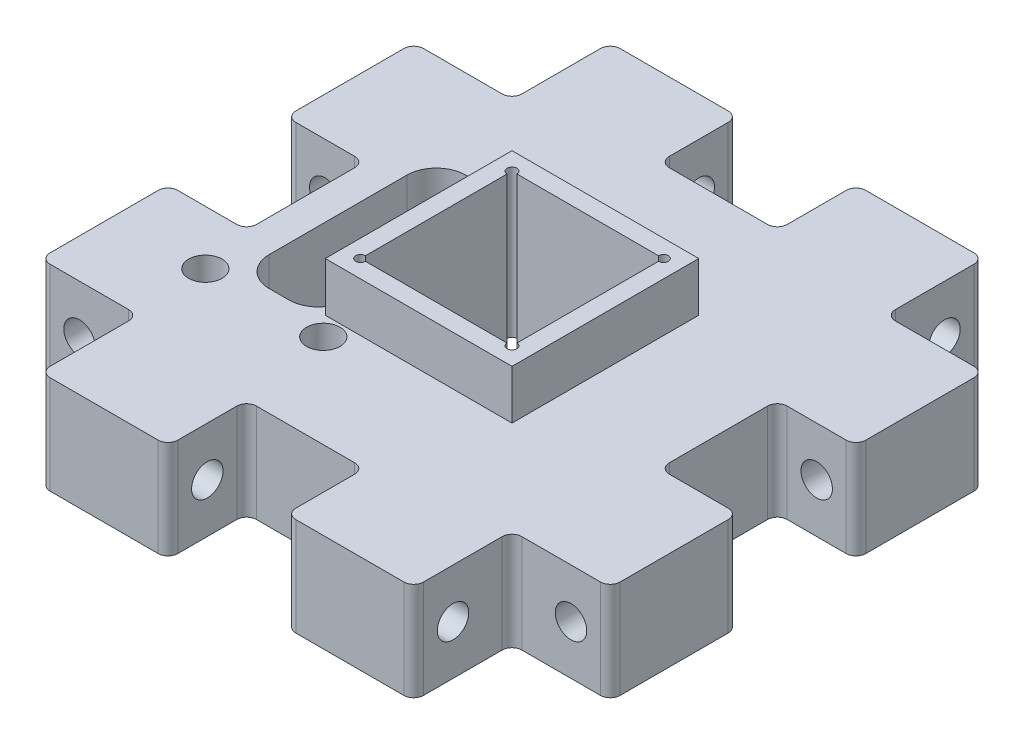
from build123d import *
from build123d.topology import SkipClean

# Parameters (mm, degrees)
SKETCH_1_W              = 58
SKETCH_1_H              = 58
SKETCH_1_W_2            = 15.4
SKETCH_1_H_2            = 15.4
EXTRUDE_1_DEPTH         = 10
CUT_EXTRUDE_1_REACH     = 44.214
SKETCH_2_W              = 12
SKETCH_2_H              = 8
SKETCH_2_W_2            = 8
SKETCH_2_H_2            = 12
CUT_EXTRUDE_2_REACH     = 67.612
SKETCH_4_R              = 1.6
CUT_EXTRUDE_3_REACH     = 67.612
SKETCH_5_R              = 1.6
CUT_EXTRUDE_4_REACH     = 67.612
SKETCH_6_R              = 1.6
CUT_EXTRUDE_5_REACH     = 67.612
SKETCH_7_R              = 1.6
CUT_EXTRUDE_6_REACH     = 44.214
SKETCH_8_W              = 8
SKETCH_8_H              = 20
CUT_EXTRUDE_7_REACH     = 44.214
SKETCH_9_R              = 0.5
SKETCH_10_W             = 19
SKETCH_10_H             = 19
EXTRUDE_2_DEPTH         = 5
CUT_EXTRUDE_8_REACH     = 45.669
SKETCH_12_W             = 10
SKETCH_12_H             = 10
FILLET_2_R              = 1
HOLE_WIZARD_3_4_3_4_1_D = 3.4
FILLET_3_R              = 3
FILLET_4_R              = 1
CUT_EXTRUDE_9_DEPTH     = 2.4


with BuildPart() as part:
    # Sketch 1 → Extrude 1 (new body)
    with BuildSketch(Plane(origin=(0, 0, 0), x_dir=(1, 0, 0), z_dir=(0, 1, 0))):
        Rectangle(SKETCH_1_W, SKETCH_1_H)
        Rectangle(SKETCH_1_W_2, SKETCH_1_H_2, mode=Mode.SUBTRACT)
    extrude(amount=EXTRUDE_1_DEPTH)

    # Sketch 2 → Cut-Extrude 1 (cut, up to next)
    with BuildSketch(Plane(origin=(0, 10, 0), x_dir=(1, 0, 0), z_dir=(0, 1, 0)), mode=Mode.PRIVATE) as cut_extrude_1_sk1:
        with Locations((0, 25)):
            Rectangle(SKETCH_2_W, SKETCH_2_H)
    cut_extrude_1_tool1 = extrude(cut_extrude_1_sk1.sketch, amount=-CUT_EXTRUDE_1_REACH, mode=Mode.PRIVATE) & part.part
    # Sketch 2 → Cut-Extrude 1 (cut, up to next)
    with BuildSketch(Plane(origin=(0, 10, 0), x_dir=(1, 0, 0), z_dir=(0, 1, 0)), mode=Mode.PRIVATE) as cut_extrude_1_sk2:
        with Locations((25, 0)):
            Rectangle(SKETCH_2_W_2, SKETCH_2_H_2)
    cut_extrude_1_tool2 = extrude(cut_extrude_1_sk2.sketch, amount=-CUT_EXTRUDE_1_REACH, mode=Mode.PRIVATE) & part.part
    # Sketch 2 → Cut-Extrude 1 (cut, up to next)
    with BuildSketch(Plane(origin=(0, 10, 0), x_dir=(1, 0, 0), z_dir=(0, 1, 0)), mode=Mode.PRIVATE) as cut_extrude_1_sk3:
        with Locations((0, -25)):
            Rectangle(SKETCH_2_W, SKETCH_2_H)
    cut_extrude_1_tool3 = extrude(cut_extrude_1_sk3.sketch, amount=-CUT_EXTRUDE_1_REACH, mode=Mode.PRIVATE) & part.part
    # Sketch 2 → Cut-Extrude 1 (cut, up to next)
    with BuildSketch(Plane(origin=(0, 10, 0), x_dir=(1, 0, 0), z_dir=(0, 1, 0)), mode=Mode.PRIVATE) as cut_extrude_1_sk4:
        with Locations((-25, 0)):
            Rectangle(SKETCH_2_W_2, SKETCH_2_H_2)
    cut_extrude_1_tool4 = extrude(cut_extrude_1_sk4.sketch, amount=-CUT_EXTRUDE_1_REACH, mode=Mode.PRIVATE) & part.part
    add(cut_extrude_1_tool1.solids().sort_by_distance((0, 10, -25))[0], mode=Mode.SUBTRACT)
    add(cut_extrude_1_tool2.solids().sort_by_distance((25, 10, 0))[0], mode=Mode.SUBTRACT)
    add(cut_extrude_1_tool3.solids().sort_by_distance((0, 10, 25))[0], mode=Mode.SUBTRACT)
    add(cut_extrude_1_tool4.solids().sort_by_distance((-25, 10, 0))[0], mode=Mode.SUBTRACT)

    # Cut-Extrude 2: up to this face of the body (flat: up to its plane)
    cut_extrude_2_end = Plane(part.part.faces().sort_by_distance((29, 5, -17.5))[0])
    # Sketch 4 → Cut-Extrude 2 (cut, up to the picked face)
    with BuildSketch(Plane.ZY.offset(29), mode=Mode.PRIVATE) as cut_extrude_2_sk1:
        with Locations((-25, 5)):
            Circle(SKETCH_4_R)
    cut_extrude_2_tool1 = split(extrude(cut_extrude_2_sk1.sketch, amount=-CUT_EXTRUDE_2_REACH, mode=Mode.PRIVATE), bisect_by=cut_extrude_2_end, keep=Keep.BOTH, mode=Mode.PRIVATE)
    add(cut_extrude_2_tool1.solids().sort_by(Axis((-29, 5, -25), (1, 0, 0)))[0], mode=Mode.SUBTRACT)

    # Cut-Extrude 3: up to this face of the body (flat: up to its plane)
    cut_extrude_3_end = Plane(part.part.faces().sort_by_distance((-17.5, 5, 29))[0])
    # Sketch 5 → Cut-Extrude 3 (cut, up to the picked face)
    with BuildSketch(Plane(origin=(0, 0, -29), x_dir=(-1, 0, 0), z_dir=(0, 0, -1)), mode=Mode.PRIVATE) as cut_extrude_3_sk1:
        with Locations((25, 5)):
            Circle(SKETCH_5_R)
    cut_extrude_3_tool1 = split(extrude(cut_extrude_3_sk1.sketch, amount=-CUT_EXTRUDE_3_REACH, mode=Mode.PRIVATE), bisect_by=cut_extrude_3_end, keep=Keep.BOTH, mode=Mode.PRIVATE)
    add(cut_extrude_3_tool1.solids().sort_by(Axis((-25, 5, -29), (0, 0, 1)))[0], mode=Mode.SUBTRACT)

    # Cut-Extrude 4: up to this face of the body (flat: up to its plane)
    cut_extrude_4_end = Plane(part.part.faces().sort_by_distance((29, 5, 17.5))[0])
    # Sketch 6 → Cut-Extrude 4 (cut, up to the picked face)
    with BuildSketch(Plane.ZY.offset(29), mode=Mode.PRIVATE) as cut_extrude_4_sk1:
        with Locations((25, 5)):
            Circle(SKETCH_6_R)
    cut_extrude_4_tool1 = split(extrude(cut_extrude_4_sk1.sketch, amount=-CUT_EXTRUDE_4_REACH, mode=Mode.PRIVATE), bisect_by=cut_extrude_4_end, keep=Keep.BOTH, mode=Mode.PRIVATE)
    add(cut_extrude_4_tool1.solids().sort_by(Axis((-29, 5, 25), (1, 0, 0)))[0], mode=Mode.SUBTRACT)

    # Cut-Extrude 5: up to this face of the body (flat: up to its plane)
    cut_extrude_5_end = Plane(part.part.faces().sort_by_distance((17.5, 5, -29))[0])
    # Sketch 7 → Cut-Extrude 5 (cut, up to the picked face)
    with BuildSketch(Plane.XY.offset(29), mode=Mode.PRIVATE) as cut_extrude_5_sk1:
        with Locations((25, 5)):
            Circle(SKETCH_7_R)
    cut_extrude_5_tool1 = split(extrude(cut_extrude_5_sk1.sketch, amount=-CUT_EXTRUDE_5_REACH, mode=Mode.PRIVATE), bisect_by=cut_extrude_5_end, keep=Keep.BOTH, mode=Mode.PRIVATE)
    add(cut_extrude_5_tool1.solids().sort_by(Axis((25, 5, 29), (0, 0, -1)))[0], mode=Mode.SUBTRACT)

    # Sketch 8 → Cut-Extrude 6 (cut, up to next)
    with BuildSketch(Plane.XZ, mode=Mode.PRIVATE) as cut_extrude_6_sk1:
        with Locations((-13.7, 0)):
            Rectangle(SKETCH_8_W, SKETCH_8_H)
    cut_extrude_6_tool1 = extrude(cut_extrude_6_sk1.sketch, amount=-CUT_EXTRUDE_6_REACH, mode=Mode.PRIVATE) & part.part
    add(cut_extrude_6_tool1.solids().sort_by_distance((-13.7, 0, 0))[0], mode=Mode.SUBTRACT)

    # Sketch 9 → Cut-Extrude 7 (cut, up to next)
    with BuildSketch(Plane(origin=(0, 0, 0), x_dir=(-1, 0, 0), z_dir=(0, -1, 0)), mode=Mode.PRIVATE) as cut_extrude_7_sk1:
        with Locations((-7.7, -7.7)):
            Circle(SKETCH_9_R)
    cut_extrude_7_tool1 = extrude(cut_extrude_7_sk1.sketch, amount=-CUT_EXTRUDE_7_REACH, mode=Mode.PRIVATE) & part.part
    # Sketch 9 → Cut-Extrude 7 (cut, up to next)
    with BuildSketch(Plane(origin=(0, 0, 0), x_dir=(-1, 0, 0), z_dir=(0, -1, 0)), mode=Mode.PRIVATE) as cut_extrude_7_sk2:
        with Locations((-7.7, 7.7)):
            Circle(SKETCH_9_R)
    cut_extrude_7_tool2 = extrude(cut_extrude_7_sk2.sketch, amount=-CUT_EXTRUDE_7_REACH, mode=Mode.PRIVATE) & part.part
    # Sketch 9 → Cut-Extrude 7 (cut, up to next)
    with BuildSketch(Plane(origin=(0, 0, 0), x_dir=(-1, 0, 0), z_dir=(0, -1, 0)), mode=Mode.PRIVATE) as cut_extrude_7_sk3:
        with Locations((7.7, 7.7)):
            Circle(SKETCH_9_R)
    cut_extrude_7_tool3 = extrude(cut_extrude_7_sk3.sketch, amount=-CUT_EXTRUDE_7_REACH, mode=Mode.PRIVATE) & part.part
    # Sketch 9 → Cut-Extrude 7 (cut, up to next)
    with BuildSketch(Plane(origin=(0, 0, 0), x_dir=(-1, 0, 0), z_dir=(0, -1, 0)), mode=Mode.PRIVATE) as cut_extrude_7_sk4:
        with Locations((7.7, -7.7)):
            Circle(SKETCH_9_R)
    cut_extrude_7_tool4 = extrude(cut_extrude_7_sk4.sketch, amount=-CUT_EXTRUDE_7_REACH, mode=Mode.PRIVATE) & part.part
    add(cut_extrude_7_tool1.solids().sort_by_distance((7.7, 0, 7.7))[0], mode=Mode.SUBTRACT)
    add(cut_extrude_7_tool2.solids().sort_by_distance((7.7, 0, -7.7))[0], mode=Mode.SUBTRACT)
    add(cut_extrude_7_tool3.solids().sort_by_distance((-7.7, 0, -7.7))[0], mode=Mode.SUBTRACT)
    add(cut_extrude_7_tool4.solids().sort_by_distance((-7.7, 0, 7.7))[0], mode=Mode.SUBTRACT)

    # Sketch 10 → Extrude 2 (add)
    with SkipClean():  # the faces are left unmerged after this step: merging them gives an invalid solid
        with BuildSketch(Plane(origin=(0, 10, 0), x_dir=(1, 0, 0), z_dir=(0, 1, 0))):
            Rectangle(SKETCH_10_W, SKETCH_10_H)
            with BuildLine():
                Line((7.2, 7.7), (-7.2, 7.7))
                ThreePointArc((-7.2, 7.7), (-8.053553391, 8.053553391), (-7.7, 7.2))
                Line((-7.7, 7.2), (-7.7, -7.2))
                ThreePointArc((-7.7, -7.2), (-8.053553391, -8.053553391), (-7.2, -7.7))
                Line((-7.2, -7.7), (7.2, -7.7))
                ThreePointArc((7.2, -7.7), (8.053553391, -8.053553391), (7.7, -7.2))
                Line((7.7, -7.2), (7.7, 7.2))
                ThreePointArc((7.7, 7.2), (8.053553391, 8.053553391), (7.2, 7.7))
            make_face(mode=Mode.SUBTRACT)
        extrude(amount=EXTRUDE_2_DEPTH)

    # Sketch 12 → Cut-Extrude 8 (cut, up to next)
    with BuildSketch(Plane.XZ, mode=Mode.PRIVATE) as cut_extrude_8_sk1:
        with Locations((-24, 24)):
            Rectangle(SKETCH_12_W, SKETCH_12_H)
    cut_extrude_8_tool1 = extrude(cut_extrude_8_sk1.sketch, amount=-CUT_EXTRUDE_8_REACH, mode=Mode.PRIVATE) & part.part
    # Sketch 12 → Cut-Extrude 8 (cut, up to next)
    with BuildSketch(Plane.XZ, mode=Mode.PRIVATE) as cut_extrude_8_sk2:
        with Locations((24, 24)):
            Rectangle(SKETCH_12_W, SKETCH_12_H)
    cut_extrude_8_tool2 = extrude(cut_extrude_8_sk2.sketch, amount=-CUT_EXTRUDE_8_REACH, mode=Mode.PRIVATE) & part.part
    # Sketch 12 → Cut-Extrude 8 (cut, up to next)
    with BuildSketch(Plane.XZ, mode=Mode.PRIVATE) as cut_extrude_8_sk3:
        with Locations((24, -24)):
            Rectangle(SKETCH_12_W, SKETCH_12_H)
    cut_extrude_8_tool3 = extrude(cut_extrude_8_sk3.sketch, amount=-CUT_EXTRUDE_8_REACH, mode=Mode.PRIVATE) & part.part
    # Sketch 12 → Cut-Extrude 8 (cut, up to next)
    with BuildSketch(Plane.XZ, mode=Mode.PRIVATE) as cut_extrude_8_sk4:
        with Locations((-24, -24)):
            Rectangle(SKETCH_12_W, SKETCH_12_H)
    cut_extrude_8_tool4 = extrude(cut_extrude_8_sk4.sketch, amount=-CUT_EXTRUDE_8_REACH, mode=Mode.PRIVATE) & part.part
    add(cut_extrude_8_tool1.solids().sort_by_distance((-24, 0, 24))[0], mode=Mode.SUBTRACT)
    add(cut_extrude_8_tool2.solids().sort_by_distance((24, 0, 24))[0], mode=Mode.SUBTRACT)
    add(cut_extrude_8_tool3.solids().sort_by_distance((24, 0, -24))[0], mode=Mode.SUBTRACT)
    add(cut_extrude_8_tool4.solids().sort_by_distance((-24, 0, -24))[0], mode=Mode.SUBTRACT)

    # Fillet 2
    fillet_2_edges = [part.edges().sort_by_distance(p)[0] for p in [
        (-29, 5, 19),
        (-19, 5, 29),
        (29, 5, 19),
        (19, 5, 29),
        (19, 5, -29),
        (29, 5, -19),
        (-29, 5, -19),
        (-19, 5, -29),
        (-6, 5, -29),
        (6, 5, -29),
        (29, 5, -6),
        (29, 5, 6),
        (6, 5, 29),
        (-6, 5, 29),
        (-29, 5, 6),
        (-29, 5, -6),
    ]]
    fillet(fillet_2_edges, radius=FILLET_2_R)

    # Hole Wizard 3.4 _3.4_ _1 (through all)
    with Locations(Plane(origin=(0, 10, 0), x_dir=(1, 0, 0), z_dir=(0, 1, 0))):
        with Locations((-19.7, -11.5), (-7.7, -11.5)):
            Hole(HOLE_WIZARD_3_4_3_4_1_D / 2)

    # Fillet 3
    fillet_3_edges = [part.edges().sort_by_distance(p)[0] for p in [
        (-9.7, 5, 10),
        (-9.7, 5, -10),
        (-17.7, 5, -10),
        (-17.7, 5, 10),
    ]]
    fillet(fillet_3_edges, radius=FILLET_3_R)

    # Fillet 4
    fillet_4_edges = [part.edges().sort_by_distance(p)[0] for p in [
        (-19, 5, 19),
        (19, 5, 19),
        (19, 5, -19),
        (-19, 5, -19),
        (-6, 5, -21),
        (6, 5, -21),
        (21, 5, 6),
        (21, 5, -6),
        (6, 5, 21),
        (-6, 5, 21),
        (-21, 5, 6),
        (-21, 5, -6),
    ]]
    fillet(fillet_4_edges, radius=FILLET_4_R)

    # Sketch 15 → Cut-Extrude 9 (cut)
    with SkipClean():  # the faces are left unmerged after this step: merging them gives an invalid solid
        with BuildSketch(Plane.XZ):
            Polygon((-17.967949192, 14.5), (-21.432050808, 14.5), (-23.164101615, 11.5), (-21.432050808, 8.5), (-17.967949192, 8.5), (-16.235898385, 11.5), align=None)
            Polygon((-5.967949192, 14.5), (-9.432050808, 14.5), (-11.164101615, 11.5), (-9.432050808, 8.5), (-5.967949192, 8.5), (-4.235898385, 11.5), align=None)
        extrude(amount=-CUT_EXTRUDE_9_DEPTH, mode=Mode.SUBTRACT)


solid = part.part
